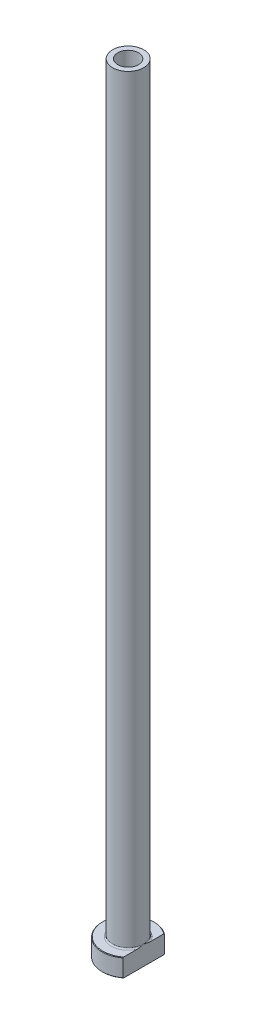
from build123d import *

# Parameters (mm, degrees)
FILLET1_R          = 0.5
CHAMFER1_SIZE      = 0.2
CUT_EXTRUDE1_DEPTH = 301.333148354
CHAMFER2_SIZE      = 0.5


with BuildPart() as part:
    # Sketch1 → Revolve1 (revolve)
    with BuildSketch(Plane.XY, mode=Mode.PRIVATE) as revolve1_sk:
        Polygon((-4, 300), (-6, 300), (-6, 7), (-10, 7), (-10, 0), (-4.25, 0), (-4.25, 243), (-4, 255), align=None)
    revolve(revolve1_sk.sketch.rotate(Axis((0, 92.187680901, 0), (0, -1, 0)), 270), axis=Axis((0, 92.187680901, 0), (0, -1, 0)))

    # Fillet1
    fillet1_edges = [part.edges().sort_by_distance(p)[0] for p in [
        (0, 7, -6),
    ]]
    fillet(fillet1_edges, radius=FILLET1_R)

    # Chamfer1
    chamfer1_edges = [part.edges().sort_by_distance(p)[0] for p in [
        (0, 0, -10),
        (0, 7, -10),
    ]]
    chamfer(chamfer1_edges, length=CHAMFER1_SIZE)

    # Sketch2 → Cut-Extrude1 (cut, through all)
    with BuildSketch(Plane.XZ):
        with BuildLine():
            Line((6, 8), (6, -8))
            ThreePointArc((6, -8), (10, 0), (6, 8))
        make_face()
    extrude(amount=-CUT_EXTRUDE1_DEPTH, mode=Mode.SUBTRACT)

    # Chamfer2
    chamfer2_edges = [part.edges().sort_by_distance(p)[0] for p in [
        (0, 0, -4.25),
    ]]
    chamfer(chamfer2_edges, length=CHAMFER2_SIZE)


solid = part.part
